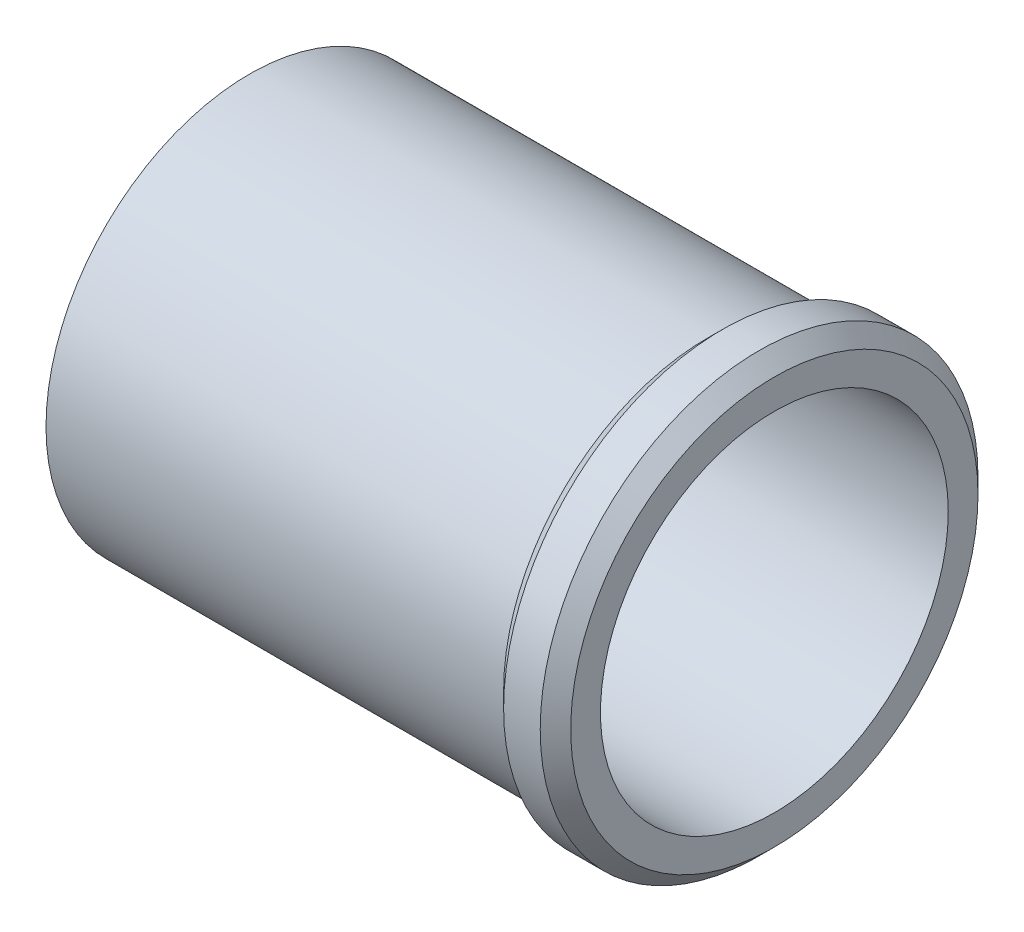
ISO-10303-21;
HEADER;
FILE_DESCRIPTION(('STEP AP214'),'2;1');
FILE_NAME('part.step','',(''),(''),'','','');
FILE_SCHEMA(('AUTOMOTIVE_DESIGN { 1 0 10303 214 1 1 1 1 }'));
ENDSEC;
DATA;
#1=APPLICATION_CONTEXT('core data for automotive mechanical design processes');
#2=APPLICATION_PROTOCOL_DEFINITION('international standard','automotive_design',2000,#1);
#3=PRODUCT_CONTEXT('',#1,'mechanical');
#4=PRODUCT('Part','Part','',(#3));
#5=PRODUCT_RELATED_PRODUCT_CATEGORY('part','',(#4));
#6=PRODUCT_DEFINITION_FORMATION('','',#4);
#7=PRODUCT_DEFINITION_CONTEXT('part definition',#1,'design');
#8=PRODUCT_DEFINITION('design','',#6,#7);
#9=PRODUCT_DEFINITION_SHAPE('','',#8);
#10=(LENGTH_UNIT() NAMED_UNIT(*) SI_UNIT(.MILLI.,.METRE.));
#11=(NAMED_UNIT(*) PLANE_ANGLE_UNIT() SI_UNIT($,.RADIAN.));
#12=(NAMED_UNIT(*) SI_UNIT($,.STERADIAN.) SOLID_ANGLE_UNIT());
#13=UNCERTAINTY_MEASURE_WITH_UNIT(LENGTH_MEASURE(1.E-05),#10,'distance_accuracy_value','');
#14=(GEOMETRIC_REPRESENTATION_CONTEXT(3) GLOBAL_UNCERTAINTY_ASSIGNED_CONTEXT((#13)) GLOBAL_UNIT_ASSIGNED_CONTEXT((#10,
#11,#12)) REPRESENTATION_CONTEXT('',''));
#15=CARTESIAN_POINT('',(0.,0.,0.));
#16=DIRECTION('',(0.,0.,1.));
#17=DIRECTION('',(1.,0.,0.));
#18=AXIS2_PLACEMENT_3D('',#15,#16,#17);
#19=CARTESIAN_POINT('',(8.7376,0.,0.));
#20=DIRECTION('',(-1.,0.,0.));
#21=DIRECTION('',(0.,0.,1.));
#22=AXIS2_PLACEMENT_3D('',#19,#20,#21);
#23=CYLINDRICAL_SURFACE('',#22,3.6449);
#24=CARTESIAN_POINT('',(8.4836,0.,0.));
#25=DIRECTION('',(1.,0.,0.));
#26=DIRECTION('',(0.,0.,-1.));
#27=AXIS2_PLACEMENT_3D('',#24,#25,#26);
#28=CIRCLE('',#27,3.6449);
#29=CARTESIAN_POINT('',(8.4836,0.,-3.6449));
#30=VERTEX_POINT('',#29);
#31=EDGE_CURVE('E10',#30,#30,#28,.F.);
#32=ORIENTED_EDGE('',*,*,#31,.T.);
#33=EDGE_LOOP('',(#32));
#34=FACE_BOUND('',#33,.T.);
#35=CARTESIAN_POINT('',(7.874,0.,0.));
#36=DIRECTION('',(-1.,0.,0.));
#37=DIRECTION('',(0.,0.,1.));
#38=AXIS2_PLACEMENT_3D('',#35,#36,#37);
#39=CIRCLE('',#38,3.6449);
#40=CARTESIAN_POINT('',(7.874,0.,3.6449));
#41=VERTEX_POINT('',#40);
#42=EDGE_CURVE('E30',#41,#41,#39,.F.);
#43=ORIENTED_EDGE('',*,*,#42,.T.);
#44=EDGE_LOOP('',(#43));
#45=FACE_BOUND('',#44,.T.);
#46=ADVANCED_FACE('F24',(#34,#45),#23,.T.);
#47=CARTESIAN_POINT('',(8.7376,0.,0.));
#48=DIRECTION('',(1.,0.,0.));
#49=DIRECTION('',(0.,0.,-1.));
#50=AXIS2_PLACEMENT_3D('',#47,#48,#49);
#51=PLANE('',#50);
#52=CARTESIAN_POINT('',(8.7376,0.,0.));
#53=DIRECTION('',(1.,0.,0.));
#54=DIRECTION('',(0.,0.,-1.));
#55=AXIS2_PLACEMENT_3D('',#52,#53,#54);
#56=CIRCLE('',#55,3.3909);
#57=CARTESIAN_POINT('',(8.7376,0.,-3.3909));
#58=VERTEX_POINT('',#57);
#59=EDGE_CURVE('E34',#58,#58,#56,.T.);
#60=ORIENTED_EDGE('',*,*,#59,.T.);
#61=EDGE_LOOP('',(#60));
#62=FACE_BOUND('',#61,.T.);
#63=CARTESIAN_POINT('',(8.7376,0.,0.));
#64=DIRECTION('',(1.,0.,0.));
#65=DIRECTION('',(0.,0.,-1.));
#66=AXIS2_PLACEMENT_3D('',#63,#64,#65);
#67=CIRCLE('',#66,2.8956);
#68=CARTESIAN_POINT('',(8.7376,0.,-2.8956));
#69=VERTEX_POINT('',#68);
#70=EDGE_CURVE('E43',#69,#69,#67,.T.);
#71=ORIENTED_EDGE('',*,*,#70,.F.);
#72=EDGE_LOOP('',(#71));
#73=FACE_BOUND('',#72,.T.);
#74=ADVANCED_FACE('F74',(#62,#73),#51,.T.);
#75=CARTESIAN_POINT('',(1.1176,0.,0.));
#76=DIRECTION('',(1.,0.,0.));
#77=DIRECTION('',(0.,0.,-1.));
#78=AXIS2_PLACEMENT_3D('',#75,#76,#77);
#79=CYLINDRICAL_SURFACE('',#78,2.8956);
#80=CARTESIAN_POINT('',(1.1176,0.,0.));
#81=DIRECTION('',(1.,0.,0.));
#82=DIRECTION('',(0.,0.,-1.));
#83=AXIS2_PLACEMENT_3D('',#80,#81,#82);
#84=CIRCLE('',#83,2.8956);
#85=CARTESIAN_POINT('',(1.1176,0.,-2.8956));
#86=VERTEX_POINT('',#85);
#87=EDGE_CURVE('E38',#86,#86,#84,.T.);
#88=CARTESIAN_POINT('',(1.1176,0.,-2.8956));
#89=CARTESIAN_POINT('',(1.196975,0.,-2.8956));
#90=CARTESIAN_POINT('',(1.27635,0.,-2.8956));
#91=CARTESIAN_POINT('',(1.4351,0.,-2.8956));
#92=CARTESIAN_POINT('',(1.514475,0.,-2.8956));
#93=CARTESIAN_POINT('',(1.673225,0.,-2.8956));
#94=CARTESIAN_POINT('',(1.7526,0.,-2.8956));
#95=CARTESIAN_POINT('',(1.91135,0.,-2.8956));
#96=CARTESIAN_POINT('',(1.990725,0.,-2.8956));
#97=CARTESIAN_POINT('',(2.149475,0.,-2.8956));
#98=CARTESIAN_POINT('',(2.22885,0.,-2.8956));
#99=CARTESIAN_POINT('',(2.3876,0.,-2.8956));
#100=CARTESIAN_POINT('',(2.466975,0.,-2.8956));
#101=CARTESIAN_POINT('',(2.625725,0.,-2.8956));
#102=CARTESIAN_POINT('',(2.7051,0.,-2.8956));
#103=CARTESIAN_POINT('',(2.86385,0.,-2.8956));
#104=CARTESIAN_POINT('',(2.943225,0.,-2.8956));
#105=CARTESIAN_POINT('',(3.101975,0.,-2.8956));
#106=CARTESIAN_POINT('',(3.18135,0.,-2.8956));
#107=CARTESIAN_POINT('',(3.3401,0.,-2.8956));
#108=CARTESIAN_POINT('',(3.419475,0.,-2.8956));
#109=CARTESIAN_POINT('',(3.578225,0.,-2.8956));
#110=CARTESIAN_POINT('',(3.6576,0.,-2.8956));
#111=CARTESIAN_POINT('',(3.81635,0.,-2.8956));
#112=CARTESIAN_POINT('',(3.895725,0.,-2.8956));
#113=CARTESIAN_POINT('',(4.054475,0.,-2.8956));
#114=CARTESIAN_POINT('',(4.13385,0.,-2.8956));
#115=CARTESIAN_POINT('',(4.2926,0.,-2.8956));
#116=CARTESIAN_POINT('',(4.371975,0.,-2.8956));
#117=CARTESIAN_POINT('',(4.530725,0.,-2.8956));
#118=CARTESIAN_POINT('',(4.6101,0.,-2.8956));
#119=CARTESIAN_POINT('',(4.76885,0.,-2.8956));
#120=CARTESIAN_POINT('',(4.848225,0.,-2.8956));
#121=CARTESIAN_POINT('',(5.006975,0.,-2.8956));
#122=CARTESIAN_POINT('',(5.08635,0.,-2.8956));
#123=CARTESIAN_POINT('',(5.2451,0.,-2.8956));
#124=CARTESIAN_POINT('',(5.324475,0.,-2.8956));
#125=CARTESIAN_POINT('',(5.483225,0.,-2.8956));
#126=CARTESIAN_POINT('',(5.5626,0.,-2.8956));
#127=CARTESIAN_POINT('',(5.72135,0.,-2.8956));
#128=CARTESIAN_POINT('',(5.800725,0.,-2.8956));
#129=CARTESIAN_POINT('',(5.959475,0.,-2.8956));
#130=CARTESIAN_POINT('',(6.03885,0.,-2.8956));
#131=CARTESIAN_POINT('',(6.1976,0.,-2.8956));
#132=CARTESIAN_POINT('',(6.276975,0.,-2.8956));
#133=CARTESIAN_POINT('',(6.435725,0.,-2.8956));
#134=CARTESIAN_POINT('',(6.5151,0.,-2.8956));
#135=CARTESIAN_POINT('',(6.67385,0.,-2.8956));
#136=CARTESIAN_POINT('',(6.753225,0.,-2.8956));
#137=CARTESIAN_POINT('',(6.911975,0.,-2.8956));
#138=CARTESIAN_POINT('',(6.99135,0.,-2.8956));
#139=CARTESIAN_POINT('',(7.1501,0.,-2.8956));
#140=CARTESIAN_POINT('',(7.229475,0.,-2.8956));
#141=CARTESIAN_POINT('',(7.388225,0.,-2.8956));
#142=CARTESIAN_POINT('',(7.4676,0.,-2.8956));
#143=CARTESIAN_POINT('',(7.62635,0.,-2.8956));
#144=CARTESIAN_POINT('',(7.705725,0.,-2.8956));
#145=CARTESIAN_POINT('',(7.864475,0.,-2.8956));
#146=CARTESIAN_POINT('',(7.94385,0.,-2.8956));
#147=CARTESIAN_POINT('',(8.1026,0.,-2.8956));
#148=CARTESIAN_POINT('',(8.181975,0.,-2.8956));
#149=CARTESIAN_POINT('',(8.340725,0.,-2.8956));
#150=CARTESIAN_POINT('',(8.4201,0.,-2.8956));
#151=CARTESIAN_POINT('',(8.57885,0.,-2.8956));
#152=CARTESIAN_POINT('',(8.658225,0.,-2.8956));
#153=CARTESIAN_POINT('',(8.7376,0.,-2.8956));
#154=B_SPLINE_CURVE_WITH_KNOTS('',3,(#88,#89,#90,#91,#92,#93,#94,#95,#96,#97,#98,#99,#100,#101,
#102,#103,#104,#105,#106,#107,#108,#109,#110,#111,#112,#113,#114,#115,#116,#117,#118,#119,#120,
#121,#122,#123,#124,#125,#126,#127,#128,#129,#130,#131,#132,#133,#134,#135,#136,#137,#138,#139,
#140,#141,#142,#143,#144,#145,#146,#147,#148,#149,#150,#151,#152,#153),.UNSPECIFIED.,.F.,.F.,(4,
2,2,2,2,2,2,2,2,2,2,2,2,2,2,2,2,2,2,2,2,2,2,2,2,2,2,2,2,2,2,2,4),(0.,0.238125,0.47625,0.714375,
0.9525,1.190625,1.42875,1.666875,1.905,2.143125,2.38125,2.619375,2.8575,3.095625,3.33375,
3.571875,3.81,4.048125,4.28625,4.524375,4.7625,5.000625,5.23875,5.476875,5.715,5.953125,6.19125,
6.429375,6.6675,6.905625,7.14375,7.381875,7.62),.UNSPECIFIED.);
#155=EDGE_CURVE('BSEAM68',#86,#69,#154,.T.);
#156=ORIENTED_EDGE('',*,*,#87,.F.);
#157=ORIENTED_EDGE('',*,*,#70,.T.);
#158=ORIENTED_EDGE('',*,*,#155,.T.);
#159=ORIENTED_EDGE('',*,*,#155,.F.);
#160=EDGE_LOOP('',(#156,#158,#157,#159));
#161=FACE_BOUND('',#160,.T.);
#162=ADVANCED_FACE('F68',(#161),#79,.F.);
#163=CARTESIAN_POINT('',(1.1176,0.,0.));
#164=DIRECTION('',(1.,0.,0.));
#165=DIRECTION('',(0.,0.,-1.));
#166=AXIS2_PLACEMENT_3D('',#163,#164,#165);
#167=PLANE('',#166);
#168=CARTESIAN_POINT('',(1.1176,-2.54,0.));
#169=DIRECTION('',(1.,0.,0.));
#170=DIRECTION('',(0.,1.,0.));
#171=AXIS2_PLACEMENT_3D('',#168,#169,#170);
#172=CIRCLE('',#171,0.3302);
#173=CARTESIAN_POINT('',(1.1176,-2.2098,0.));
#174=VERTEX_POINT('',#173);
#175=EDGE_CURVE('E58',#174,#174,#172,.T.);
#176=ORIENTED_EDGE('',*,*,#175,.F.);
#177=EDGE_LOOP('',(#176));
#178=FACE_BOUND('',#177,.T.);
#179=ORIENTED_EDGE('',*,*,#87,.T.);
#180=EDGE_LOOP('',(#179));
#181=FACE_BOUND('',#180,.T.);
#182=ADVANCED_FACE('F64',(#178,#181),#167,.T.);
#183=CARTESIAN_POINT('',(7.62,0.,0.));
#184=DIRECTION('',(-1.,0.,0.));
#185=DIRECTION('',(0.,0.,1.));
#186=AXIS2_PLACEMENT_3D('',#183,#184,#185);
#187=CYLINDRICAL_SURFACE('',#186,3.3909);
#188=CARTESIAN_POINT('',(7.62,0.,0.));
#189=DIRECTION('',(-1.,0.,0.));
#190=DIRECTION('',(0.,0.,1.));
#191=AXIS2_PLACEMENT_3D('',#188,#189,#190);
#192=CIRCLE('',#191,3.3909);
#193=CARTESIAN_POINT('',(7.62,0.,3.3909));
#194=VERTEX_POINT('',#193);
#195=EDGE_CURVE('E46',#194,#194,#192,.T.);
#196=CARTESIAN_POINT('',(0.,0.,0.));
#197=DIRECTION('',(-1.,0.,0.));
#198=DIRECTION('',(0.,0.,1.));
#199=AXIS2_PLACEMENT_3D('',#196,#197,#198);
#200=CIRCLE('',#199,3.3909);
#201=CARTESIAN_POINT('',(0.,0.,3.3909));
#202=VERTEX_POINT('',#201);
#203=EDGE_CURVE('E49',#202,#202,#200,.T.);
#204=CARTESIAN_POINT('',(7.62,0.,3.3909));
#205=CARTESIAN_POINT('',(7.540625,0.,3.3909));
#206=CARTESIAN_POINT('',(7.46125,0.,3.3909));
#207=CARTESIAN_POINT('',(7.3025,0.,3.3909));
#208=CARTESIAN_POINT('',(7.223125,0.,3.3909));
#209=CARTESIAN_POINT('',(7.064375,0.,3.3909));
#210=CARTESIAN_POINT('',(6.985,0.,3.3909));
#211=CARTESIAN_POINT('',(6.82625,0.,3.3909));
#212=CARTESIAN_POINT('',(6.746875,0.,3.3909));
#213=CARTESIAN_POINT('',(6.588125,0.,3.3909));
#214=CARTESIAN_POINT('',(6.50875,0.,3.3909));
#215=CARTESIAN_POINT('',(6.35,0.,3.3909));
#216=CARTESIAN_POINT('',(6.270625,0.,3.3909));
#217=CARTESIAN_POINT('',(6.111875,0.,3.3909));
#218=CARTESIAN_POINT('',(6.0325,0.,3.3909));
#219=CARTESIAN_POINT('',(5.87375,0.,3.3909));
#220=CARTESIAN_POINT('',(5.794375,0.,3.3909));
#221=CARTESIAN_POINT('',(5.635625,0.,3.3909));
#222=CARTESIAN_POINT('',(5.55625,0.,3.3909));
#223=CARTESIAN_POINT('',(5.3975,0.,3.3909));
#224=CARTESIAN_POINT('',(5.318125,0.,3.3909));
#225=CARTESIAN_POINT('',(5.159375,0.,3.3909));
#226=CARTESIAN_POINT('',(5.08,0.,3.3909));
#227=CARTESIAN_POINT('',(4.92125,0.,3.3909));
#228=CARTESIAN_POINT('',(4.841875,0.,3.3909));
#229=CARTESIAN_POINT('',(4.683125,0.,3.3909));
#230=CARTESIAN_POINT('',(4.60375,0.,3.3909));
#231=CARTESIAN_POINT('',(4.445,0.,3.3909));
#232=CARTESIAN_POINT('',(4.365625,0.,3.3909));
#233=CARTESIAN_POINT('',(4.206875,0.,3.3909));
#234=CARTESIAN_POINT('',(4.1275,0.,3.3909));
#235=CARTESIAN_POINT('',(3.96875,0.,3.3909));
#236=CARTESIAN_POINT('',(3.889375,0.,3.3909));
#237=CARTESIAN_POINT('',(3.730625,0.,3.3909));
#238=CARTESIAN_POINT('',(3.65125,0.,3.3909));
#239=CARTESIAN_POINT('',(3.4925,0.,3.3909));
#240=CARTESIAN_POINT('',(3.413125,0.,3.3909));
#241=CARTESIAN_POINT('',(3.254375,0.,3.3909));
#242=CARTESIAN_POINT('',(3.175,0.,3.3909));
#243=CARTESIAN_POINT('',(3.01625,0.,3.3909));
#244=CARTESIAN_POINT('',(2.936875,0.,3.3909));
#245=CARTESIAN_POINT('',(2.778125,0.,3.3909));
#246=CARTESIAN_POINT('',(2.69875,0.,3.3909));
#247=CARTESIAN_POINT('',(2.54,0.,3.3909));
#248=CARTESIAN_POINT('',(2.460625,0.,3.3909));
#249=CARTESIAN_POINT('',(2.301875,0.,3.3909));
#250=CARTESIAN_POINT('',(2.2225,0.,3.3909));
#251=CARTESIAN_POINT('',(2.06375,0.,3.3909));
#252=CARTESIAN_POINT('',(1.984375,0.,3.3909));
#253=CARTESIAN_POINT('',(1.825625,0.,3.3909));
#254=CARTESIAN_POINT('',(1.74625,0.,3.3909));
#255=CARTESIAN_POINT('',(1.5875,0.,3.3909));
#256=CARTESIAN_POINT('',(1.508125,0.,3.3909));
#257=CARTESIAN_POINT('',(1.349375,0.,3.3909));
#258=CARTESIAN_POINT('',(1.27,0.,3.3909));
#259=CARTESIAN_POINT('',(1.11125,0.,3.3909));
#260=CARTESIAN_POINT('',(1.031875,0.,3.3909));
#261=CARTESIAN_POINT('',(0.873125,0.,3.3909));
#262=CARTESIAN_POINT('',(0.79375,0.,3.3909));
#263=CARTESIAN_POINT('',(0.635,0.,3.3909));
#264=CARTESIAN_POINT('',(0.555625,0.,3.3909));
#265=CARTESIAN_POINT('',(0.396875,0.,3.3909));
#266=CARTESIAN_POINT('',(0.3175,0.,3.3909));
#267=CARTESIAN_POINT('',(0.15875,0.,3.3909));
#268=CARTESIAN_POINT('',(0.0793749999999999,0.,3.3909));
#269=CARTESIAN_POINT('',(0.,0.,3.3909));
#270=B_SPLINE_CURVE_WITH_KNOTS('',3,(#204,#205,#206,#207,#208,#209,#210,#211,#212,#213,#214,
#215,#216,#217,#218,#219,#220,#221,#222,#223,#224,#225,#226,#227,#228,#229,#230,#231,#232,#233,
#234,#235,#236,#237,#238,#239,#240,#241,#242,#243,#244,#245,#246,#247,#248,#249,#250,#251,#252,
#253,#254,#255,#256,#257,#258,#259,#260,#261,#262,#263,#264,#265,#266,#267,#268,#269),
.UNSPECIFIED.,.F.,.F.,(4,2,2,2,2,2,2,2,2,2,2,2,2,2,2,2,2,2,2,2,2,2,2,2,2,2,2,2,2,2,2,2,4),(0.,
0.238125,0.47625,0.714375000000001,0.9525,1.190625,1.42875,1.666875,1.905,2.143125,2.38125,
2.619375,2.8575,3.095625,3.33375,3.571875,3.81,4.048125,4.28625,4.524375,4.7625,5.000625,
5.23875,5.476875,5.715,5.953125,6.19125,6.429375,6.6675,6.905625,7.14375,7.381875,7.62),.UNSPECIFIED.);
#271=EDGE_CURVE('BSEAM67',#194,#202,#270,.T.);
#272=ORIENTED_EDGE('',*,*,#195,.T.);
#273=ORIENTED_EDGE('',*,*,#203,.F.);
#274=ORIENTED_EDGE('',*,*,#271,.T.);
#275=ORIENTED_EDGE('',*,*,#271,.F.);
#276=EDGE_LOOP('',(#272,#274,#273,#275));
#277=FACE_BOUND('',#276,.T.);
#278=ADVANCED_FACE('F67',(#277),#187,.T.);
#279=CARTESIAN_POINT('',(0.,0.,0.));
#280=DIRECTION('',(1.,0.,0.));
#281=DIRECTION('',(0.,0.,-1.));
#282=AXIS2_PLACEMENT_3D('',#279,#280,#281);
#283=PLANE('',#282);
#284=CARTESIAN_POINT('',(0.,-2.54,0.));
#285=DIRECTION('',(1.,0.,0.));
#286=DIRECTION('',(0.,1.,0.));
#287=AXIS2_PLACEMENT_3D('',#284,#285,#286);
#288=CIRCLE('',#287,0.771797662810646);
#289=CARTESIAN_POINT('',(0.,-1.76820233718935,0.));
#290=VERTEX_POINT('',#289);
#291=EDGE_CURVE('E52',#290,#290,#288,.T.);
#292=ORIENTED_EDGE('',*,*,#291,.T.);
#293=EDGE_LOOP('',(#292));
#294=FACE_BOUND('',#293,.T.);
#295=ORIENTED_EDGE('',*,*,#203,.T.);
#296=EDGE_LOOP('',(#295));
#297=FACE_BOUND('',#296,.T.);
#298=ADVANCED_FACE('F84',(#294,#297),#283,.F.);
#299=CARTESIAN_POINT('',(8.7376,0.,0.));
#300=DIRECTION('',(-1.,0.,0.));
#301=DIRECTION('',(0.,0.,1.));
#302=AXIS2_PLACEMENT_3D('',#299,#300,#301);
#303=CONICAL_SURFACE('',#302,3.3909,0.785398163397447);
#304=ORIENTED_EDGE('',*,*,#31,.F.);
#305=EDGE_LOOP('',(#304));
#306=FACE_BOUND('',#305,.T.);
#307=ORIENTED_EDGE('',*,*,#59,.F.);
#308=EDGE_LOOP('',(#307));
#309=FACE_BOUND('',#308,.T.);
#310=ADVANCED_FACE('F86',(#306,#309),#303,.T.);
#311=CARTESIAN_POINT('',(7.62,0.,0.));
#312=DIRECTION('',(1.,0.,0.));
#313=DIRECTION('',(0.,0.,-1.));
#314=AXIS2_PLACEMENT_3D('',#311,#312,#313);
#315=CONICAL_SURFACE('',#314,3.3909,0.785398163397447);
#316=ORIENTED_EDGE('',*,*,#42,.F.);
#317=EDGE_LOOP('',(#316));
#318=FACE_BOUND('',#317,.T.);
#319=ORIENTED_EDGE('',*,*,#195,.F.);
#320=EDGE_LOOP('',(#319));
#321=FACE_BOUND('',#320,.T.);
#322=ADVANCED_FACE('F94',(#318,#321),#315,.T.);
#323=CARTESIAN_POINT('',(0.508,-2.54,0.));
#324=DIRECTION('',(-1.,0.,0.));
#325=DIRECTION('',(0.,-1.,0.));
#326=AXIS2_PLACEMENT_3D('',#323,#324,#325);
#327=CONICAL_SURFACE('',#326,0.3302,0.715584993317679);
#328=ORIENTED_EDGE('',*,*,#291,.F.);
#329=EDGE_LOOP('',(#328));
#330=FACE_BOUND('',#329,.T.);
#331=CARTESIAN_POINT('',(0.508,-2.54,0.));
#332=DIRECTION('',(1.,0.,0.));
#333=DIRECTION('',(0.,1.,0.));
#334=AXIS2_PLACEMENT_3D('',#331,#332,#333);
#335=CIRCLE('',#334,0.3302);
#336=CARTESIAN_POINT('',(0.508,-2.2098,0.));
#337=VERTEX_POINT('',#336);
#338=EDGE_CURVE('E55',#337,#337,#335,.T.);
#339=ORIENTED_EDGE('',*,*,#338,.T.);
#340=EDGE_LOOP('',(#339));
#341=FACE_BOUND('',#340,.T.);
#342=ADVANCED_FACE('F98',(#330,#341),#327,.F.);
#343=CARTESIAN_POINT('',(3.55930446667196,-2.54,0.));
#344=DIRECTION('',(1.,0.,0.));
#345=DIRECTION('',(0.,1.,0.));
#346=AXIS2_PLACEMENT_3D('',#343,#344,#345);
#347=CYLINDRICAL_SURFACE('',#346,0.3302);
#348=ORIENTED_EDGE('',*,*,#338,.F.);
#349=EDGE_LOOP('',(#348));
#350=FACE_BOUND('',#349,.T.);
#351=ORIENTED_EDGE('',*,*,#175,.T.);
#352=EDGE_LOOP('',(#351));
#353=FACE_BOUND('',#352,.T.);
#354=ADVANCED_FACE('F62',(#350,#353),#347,.F.);
#355=CLOSED_SHELL('',(#46,#74,#162,#182,#278,#298,#310,#322,#342,#354));
#356=MANIFOLD_SOLID_BREP('B2',#355);
#357=ADVANCED_BREP_SHAPE_REPRESENTATION('',(#18,#356),#14);
#358=SHAPE_DEFINITION_REPRESENTATION(#9,#357);
ENDSEC;
END-ISO-10303-21;
